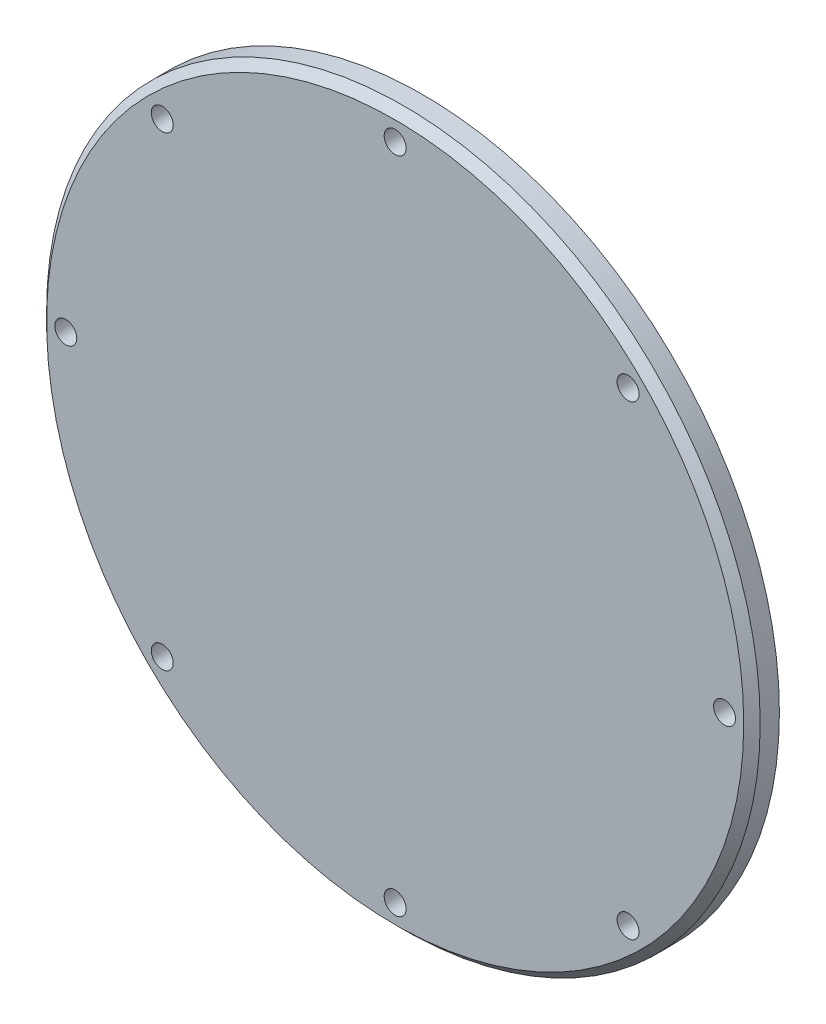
ISO-10303-21;
HEADER;
FILE_DESCRIPTION(('STEP AP214'),'2;1');
FILE_NAME('part.step','',(''),(''),'','','');
FILE_SCHEMA(('AUTOMOTIVE_DESIGN { 1 0 10303 214 1 1 1 1 }'));
ENDSEC;
DATA;
#1=APPLICATION_CONTEXT('core data for automotive mechanical design processes');
#2=APPLICATION_PROTOCOL_DEFINITION('international standard','automotive_design',2000,#1);
#3=PRODUCT_CONTEXT('',#1,'mechanical');
#4=PRODUCT('Part','Part','',(#3));
#5=PRODUCT_RELATED_PRODUCT_CATEGORY('part','',(#4));
#6=PRODUCT_DEFINITION_FORMATION('','',#4);
#7=PRODUCT_DEFINITION_CONTEXT('part definition',#1,'design');
#8=PRODUCT_DEFINITION('design','',#6,#7);
#9=PRODUCT_DEFINITION_SHAPE('','',#8);
#10=(LENGTH_UNIT() NAMED_UNIT(*) SI_UNIT(.MILLI.,.METRE.));
#11=(NAMED_UNIT(*) PLANE_ANGLE_UNIT() SI_UNIT($,.RADIAN.));
#12=(NAMED_UNIT(*) SI_UNIT($,.STERADIAN.) SOLID_ANGLE_UNIT());
#13=UNCERTAINTY_MEASURE_WITH_UNIT(LENGTH_MEASURE(1.E-05),#10,'distance_accuracy_value','');
#14=(GEOMETRIC_REPRESENTATION_CONTEXT(3) GLOBAL_UNCERTAINTY_ASSIGNED_CONTEXT((#13)) GLOBAL_UNIT_ASSIGNED_CONTEXT((#10,
#11,#12)) REPRESENTATION_CONTEXT('',''));
#15=CARTESIAN_POINT('',(0.,0.,0.));
#16=DIRECTION('',(0.,0.,1.));
#17=DIRECTION('',(1.,0.,0.));
#18=AXIS2_PLACEMENT_3D('',#15,#16,#17);
#19=CARTESIAN_POINT('',(-162.897779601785,-125.,10.));
#20=DIRECTION('',(0.,0.,1.));
#21=DIRECTION('',(1.,0.,0.));
#22=AXIS2_PLACEMENT_3D('',#19,#20,#21);
#23=PLANE('',#22);
#24=CARTESIAN_POINT('',(-162.897779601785,-125.,10.));
#25=DIRECTION('',(0.,0.,1.));
#26=DIRECTION('',(1.,0.,0.));
#27=AXIS2_PLACEMENT_3D('',#24,#25,#26);
#28=CIRCLE('',#27,127.);
#29=CARTESIAN_POINT('',(-35.8977796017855,-125.,10.));
#30=VERTEX_POINT('',#29);
#31=EDGE_CURVE('E38',#30,#30,#28,.T.);
#32=ORIENTED_EDGE('',*,*,#31,.T.);
#33=EDGE_LOOP('',(#32));
#34=FACE_BOUND('',#33,.T.);
#35=CARTESIAN_POINT('',(-78.0449658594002,-209.852813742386,10.));
#36=DIRECTION('',(0.,0.,1.));
#37=DIRECTION('',(1.,0.,0.));
#38=AXIS2_PLACEMENT_3D('',#35,#36,#37);
#39=CIRCLE('',#38,4.00000000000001);
#40=CARTESIAN_POINT('',(-74.0449658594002,-209.852813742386,10.));
#41=VERTEX_POINT('',#40);
#42=EDGE_CURVE('E82',#41,#41,#39,.T.);
#43=ORIENTED_EDGE('',*,*,#42,.F.);
#44=EDGE_LOOP('',(#43));
#45=FACE_BOUND('',#44,.T.);
#46=CARTESIAN_POINT('',(-247.750593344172,-209.852813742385,10.));
#47=DIRECTION('',(0.,0.,1.));
#48=DIRECTION('',(1.,0.,0.));
#49=AXIS2_PLACEMENT_3D('',#46,#47,#48);
#50=CIRCLE('',#49,3.99999999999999);
#51=CARTESIAN_POINT('',(-243.750593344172,-209.852813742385,10.));
#52=VERTEX_POINT('',#51);
#53=EDGE_CURVE('E70',#52,#52,#50,.T.);
#54=ORIENTED_EDGE('',*,*,#53,.F.);
#55=EDGE_LOOP('',(#54));
#56=FACE_BOUND('',#55,.T.);
#57=CARTESIAN_POINT('',(-247.75059334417,-40.1471862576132,10.));
#58=DIRECTION('',(0.,0.,1.));
#59=DIRECTION('',(1.,0.,0.));
#60=AXIS2_PLACEMENT_3D('',#57,#58,#59);
#61=CIRCLE('',#60,3.99999999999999);
#62=CARTESIAN_POINT('',(-243.75059334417,-40.1471862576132,10.));
#63=VERTEX_POINT('',#62);
#64=EDGE_CURVE('E58',#63,#63,#61,.T.);
#65=ORIENTED_EDGE('',*,*,#64,.F.);
#66=EDGE_LOOP('',(#65));
#67=FACE_BOUND('',#66,.T.);
#68=CARTESIAN_POINT('',(-78.0449658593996,-40.1471862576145,10.));
#69=DIRECTION('',(0.,0.,1.));
#70=DIRECTION('',(1.,0.,0.));
#71=AXIS2_PLACEMENT_3D('',#68,#69,#70);
#72=CIRCLE('',#71,3.99999999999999);
#73=CARTESIAN_POINT('',(-74.0449658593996,-40.1471862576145,10.));
#74=VERTEX_POINT('',#73);
#75=EDGE_CURVE('E46',#74,#74,#72,.T.);
#76=ORIENTED_EDGE('',*,*,#75,.F.);
#77=EDGE_LOOP('',(#76));
#78=FACE_BOUND('',#77,.T.);
#79=CARTESIAN_POINT('',(-162.897779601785,-5.,10.));
#80=DIRECTION('',(0.,0.,1.));
#81=DIRECTION('',(1.,0.,0.));
#82=AXIS2_PLACEMENT_3D('',#79,#80,#81);
#83=CIRCLE('',#82,3.99999999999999);
#84=CARTESIAN_POINT('',(-158.897779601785,-5.,10.));
#85=VERTEX_POINT('',#84);
#86=EDGE_CURVE('E52',#85,#85,#83,.T.);
#87=ORIENTED_EDGE('',*,*,#86,.F.);
#88=EDGE_LOOP('',(#87));
#89=FACE_BOUND('',#88,.T.);
#90=CARTESIAN_POINT('',(-282.897779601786,-124.999999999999,10.));
#91=DIRECTION('',(0.,0.,1.));
#92=DIRECTION('',(1.,0.,0.));
#93=AXIS2_PLACEMENT_3D('',#90,#91,#92);
#94=CIRCLE('',#93,3.99999999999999);
#95=CARTESIAN_POINT('',(-278.897779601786,-124.999999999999,10.));
#96=VERTEX_POINT('',#95);
#97=EDGE_CURVE('E64',#96,#96,#94,.T.);
#98=ORIENTED_EDGE('',*,*,#97,.F.);
#99=EDGE_LOOP('',(#98));
#100=FACE_BOUND('',#99,.T.);
#101=CARTESIAN_POINT('',(-162.897779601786,-245.,10.));
#102=DIRECTION('',(0.,0.,1.));
#103=DIRECTION('',(1.,0.,0.));
#104=AXIS2_PLACEMENT_3D('',#101,#102,#103);
#105=CIRCLE('',#104,3.99999999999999);
#106=CARTESIAN_POINT('',(-158.897779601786,-245.,10.));
#107=VERTEX_POINT('',#106);
#108=EDGE_CURVE('E76',#107,#107,#105,.T.);
#109=ORIENTED_EDGE('',*,*,#108,.F.);
#110=EDGE_LOOP('',(#109));
#111=FACE_BOUND('',#110,.T.);
#112=CARTESIAN_POINT('',(-42.8977796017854,-125.,10.));
#113=DIRECTION('',(0.,0.,1.));
#114=DIRECTION('',(1.,0.,0.));
#115=AXIS2_PLACEMENT_3D('',#112,#113,#114);
#116=CIRCLE('',#115,3.99999999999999);
#117=CARTESIAN_POINT('',(-38.8977796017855,-125.,10.));
#118=VERTEX_POINT('',#117);
#119=EDGE_CURVE('E88',#118,#118,#116,.T.);
#120=ORIENTED_EDGE('',*,*,#119,.F.);
#121=EDGE_LOOP('',(#120));
#122=FACE_BOUND('',#121,.T.);
#123=ADVANCED_FACE('F31',(#34,#45,#56,#67,#78,#89,#100,#111,#122),#23,.T.);
#124=CARTESIAN_POINT('',(-162.897779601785,-125.,0.));
#125=DIRECTION('',(0.,0.,1.));
#126=DIRECTION('',(1.,0.,0.));
#127=AXIS2_PLACEMENT_3D('',#124,#125,#126);
#128=PLANE('',#127);
#129=CARTESIAN_POINT('',(-78.0449658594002,-209.852813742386,0.));
#130=DIRECTION('',(0.,0.,1.));
#131=DIRECTION('',(1.,0.,0.));
#132=AXIS2_PLACEMENT_3D('',#129,#130,#131);
#133=CIRCLE('',#132,4.00000000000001);
#134=CARTESIAN_POINT('',(-74.0449658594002,-209.852813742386,0.));
#135=VERTEX_POINT('',#134);
#136=EDGE_CURVE('E85',#135,#135,#133,.T.);
#137=ORIENTED_EDGE('',*,*,#136,.T.);
#138=EDGE_LOOP('',(#137));
#139=FACE_BOUND('',#138,.T.);
#140=CARTESIAN_POINT('',(-247.750593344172,-209.852813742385,0.));
#141=DIRECTION('',(0.,0.,1.));
#142=DIRECTION('',(1.,0.,0.));
#143=AXIS2_PLACEMENT_3D('',#140,#141,#142);
#144=CIRCLE('',#143,3.99999999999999);
#145=CARTESIAN_POINT('',(-243.750593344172,-209.852813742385,0.));
#146=VERTEX_POINT('',#145);
#147=EDGE_CURVE('E73',#146,#146,#144,.T.);
#148=ORIENTED_EDGE('',*,*,#147,.T.);
#149=EDGE_LOOP('',(#148));
#150=FACE_BOUND('',#149,.T.);
#151=CARTESIAN_POINT('',(-247.75059334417,-40.1471862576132,0.));
#152=DIRECTION('',(0.,0.,1.));
#153=DIRECTION('',(1.,0.,0.));
#154=AXIS2_PLACEMENT_3D('',#151,#152,#153);
#155=CIRCLE('',#154,3.99999999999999);
#156=CARTESIAN_POINT('',(-243.75059334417,-40.1471862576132,0.));
#157=VERTEX_POINT('',#156);
#158=EDGE_CURVE('E61',#157,#157,#155,.T.);
#159=ORIENTED_EDGE('',*,*,#158,.T.);
#160=EDGE_LOOP('',(#159));
#161=FACE_BOUND('',#160,.T.);
#162=CARTESIAN_POINT('',(-78.0449658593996,-40.1471862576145,0.));
#163=DIRECTION('',(0.,0.,1.));
#164=DIRECTION('',(1.,0.,0.));
#165=AXIS2_PLACEMENT_3D('',#162,#163,#164);
#166=CIRCLE('',#165,3.99999999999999);
#167=CARTESIAN_POINT('',(-74.0449658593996,-40.1471862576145,0.));
#168=VERTEX_POINT('',#167);
#169=EDGE_CURVE('E49',#168,#168,#166,.T.);
#170=ORIENTED_EDGE('',*,*,#169,.T.);
#171=EDGE_LOOP('',(#170));
#172=FACE_BOUND('',#171,.T.);
#173=CARTESIAN_POINT('',(-162.897779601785,-125.,0.));
#174=DIRECTION('',(0.,0.,1.));
#175=DIRECTION('',(1.,0.,0.));
#176=AXIS2_PLACEMENT_3D('',#173,#174,#175);
#177=CIRCLE('',#176,130.);
#178=CARTESIAN_POINT('',(-32.8977796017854,-125.,0.));
#179=VERTEX_POINT('',#178);
#180=EDGE_CURVE('E42',#179,#179,#177,.T.);
#181=ORIENTED_EDGE('',*,*,#180,.F.);
#182=EDGE_LOOP('',(#181));
#183=FACE_BOUND('',#182,.T.);
#184=CARTESIAN_POINT('',(-162.897779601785,-5.,0.));
#185=DIRECTION('',(0.,0.,1.));
#186=DIRECTION('',(1.,0.,0.));
#187=AXIS2_PLACEMENT_3D('',#184,#185,#186);
#188=CIRCLE('',#187,3.99999999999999);
#189=CARTESIAN_POINT('',(-158.897779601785,-5.,0.));
#190=VERTEX_POINT('',#189);
#191=EDGE_CURVE('E55',#190,#190,#188,.T.);
#192=ORIENTED_EDGE('',*,*,#191,.T.);
#193=EDGE_LOOP('',(#192));
#194=FACE_BOUND('',#193,.T.);
#195=CARTESIAN_POINT('',(-282.897779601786,-124.999999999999,0.));
#196=DIRECTION('',(0.,0.,1.));
#197=DIRECTION('',(1.,0.,0.));
#198=AXIS2_PLACEMENT_3D('',#195,#196,#197);
#199=CIRCLE('',#198,3.99999999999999);
#200=CARTESIAN_POINT('',(-278.897779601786,-124.999999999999,0.));
#201=VERTEX_POINT('',#200);
#202=EDGE_CURVE('E67',#201,#201,#199,.T.);
#203=ORIENTED_EDGE('',*,*,#202,.T.);
#204=EDGE_LOOP('',(#203));
#205=FACE_BOUND('',#204,.T.);
#206=CARTESIAN_POINT('',(-162.897779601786,-245.,0.));
#207=DIRECTION('',(0.,0.,1.));
#208=DIRECTION('',(1.,0.,0.));
#209=AXIS2_PLACEMENT_3D('',#206,#207,#208);
#210=CIRCLE('',#209,3.99999999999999);
#211=CARTESIAN_POINT('',(-158.897779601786,-245.,0.));
#212=VERTEX_POINT('',#211);
#213=EDGE_CURVE('E79',#212,#212,#210,.T.);
#214=ORIENTED_EDGE('',*,*,#213,.T.);
#215=EDGE_LOOP('',(#214));
#216=FACE_BOUND('',#215,.T.);
#217=CARTESIAN_POINT('',(-42.8977796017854,-125.,0.));
#218=DIRECTION('',(0.,0.,1.));
#219=DIRECTION('',(1.,0.,0.));
#220=AXIS2_PLACEMENT_3D('',#217,#218,#219);
#221=CIRCLE('',#220,3.99999999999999);
#222=CARTESIAN_POINT('',(-38.8977796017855,-125.,0.));
#223=VERTEX_POINT('',#222);
#224=EDGE_CURVE('E91',#223,#223,#221,.T.);
#225=ORIENTED_EDGE('',*,*,#224,.T.);
#226=EDGE_LOOP('',(#225));
#227=FACE_BOUND('',#226,.T.);
#228=ADVANCED_FACE('F101',(#139,#150,#161,#172,#183,#194,#205,#216,#227),#128,.F.);
#229=CARTESIAN_POINT('',(-162.897779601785,-125.,10.));
#230=DIRECTION('',(0.,0.,-1.));
#231=DIRECTION('',(-1.,0.,0.));
#232=AXIS2_PLACEMENT_3D('',#229,#230,#231);
#233=CYLINDRICAL_SURFACE('',#232,130.);
#234=CARTESIAN_POINT('',(-162.897779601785,-125.,6.99999999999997));
#235=DIRECTION('',(0.,0.,1.));
#236=DIRECTION('',(1.,0.,0.));
#237=AXIS2_PLACEMENT_3D('',#234,#235,#236);
#238=CIRCLE('',#237,130.);
#239=CARTESIAN_POINT('',(-32.8977796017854,-125.,6.99999999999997));
#240=VERTEX_POINT('',#239);
#241=EDGE_CURVE('E10',#240,#240,#238,.F.);
#242=ORIENTED_EDGE('',*,*,#241,.T.);
#243=EDGE_LOOP('',(#242));
#244=FACE_BOUND('',#243,.T.);
#245=ORIENTED_EDGE('',*,*,#180,.T.);
#246=EDGE_LOOP('',(#245));
#247=FACE_BOUND('',#246,.T.);
#248=ADVANCED_FACE('F106',(#244,#247),#233,.T.);
#249=CARTESIAN_POINT('',(-78.0449658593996,-40.1471862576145,10.));
#250=DIRECTION('',(0.,0.,-1.));
#251=DIRECTION('',(-1.,0.,0.));
#252=AXIS2_PLACEMENT_3D('',#249,#250,#251);
#253=CYLINDRICAL_SURFACE('',#252,3.99999999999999);
#254=ORIENTED_EDGE('',*,*,#75,.T.);
#255=EDGE_LOOP('',(#254));
#256=FACE_BOUND('',#255,.T.);
#257=ORIENTED_EDGE('',*,*,#169,.F.);
#258=EDGE_LOOP('',(#257));
#259=FACE_BOUND('',#258,.T.);
#260=ADVANCED_FACE('F111',(#256,#259),#253,.F.);
#261=CARTESIAN_POINT('',(-162.897779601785,-5.,10.));
#262=DIRECTION('',(0.,0.,-1.));
#263=DIRECTION('',(-1.,0.,0.));
#264=AXIS2_PLACEMENT_3D('',#261,#262,#263);
#265=CYLINDRICAL_SURFACE('',#264,3.99999999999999);
#266=ORIENTED_EDGE('',*,*,#86,.T.);
#267=EDGE_LOOP('',(#266));
#268=FACE_BOUND('',#267,.T.);
#269=ORIENTED_EDGE('',*,*,#191,.F.);
#270=EDGE_LOOP('',(#269));
#271=FACE_BOUND('',#270,.T.);
#272=ADVANCED_FACE('F117',(#268,#271),#265,.F.);
#273=CARTESIAN_POINT('',(-247.75059334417,-40.1471862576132,10.));
#274=DIRECTION('',(0.,0.,-1.));
#275=DIRECTION('',(-1.,0.,0.));
#276=AXIS2_PLACEMENT_3D('',#273,#274,#275);
#277=CYLINDRICAL_SURFACE('',#276,3.99999999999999);
#278=ORIENTED_EDGE('',*,*,#64,.T.);
#279=EDGE_LOOP('',(#278));
#280=FACE_BOUND('',#279,.T.);
#281=ORIENTED_EDGE('',*,*,#158,.F.);
#282=EDGE_LOOP('',(#281));
#283=FACE_BOUND('',#282,.T.);
#284=ADVANCED_FACE('F152',(#280,#283),#277,.F.);
#285=CARTESIAN_POINT('',(-282.897779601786,-124.999999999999,10.));
#286=DIRECTION('',(0.,0.,-1.));
#287=DIRECTION('',(-1.,0.,0.));
#288=AXIS2_PLACEMENT_3D('',#285,#286,#287);
#289=CYLINDRICAL_SURFACE('',#288,3.99999999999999);
#290=ORIENTED_EDGE('',*,*,#97,.T.);
#291=EDGE_LOOP('',(#290));
#292=FACE_BOUND('',#291,.T.);
#293=ORIENTED_EDGE('',*,*,#202,.F.);
#294=EDGE_LOOP('',(#293));
#295=FACE_BOUND('',#294,.T.);
#296=ADVANCED_FACE('F148',(#292,#295),#289,.F.);
#297=CARTESIAN_POINT('',(-247.750593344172,-209.852813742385,10.));
#298=DIRECTION('',(0.,0.,-1.));
#299=DIRECTION('',(-1.,0.,0.));
#300=AXIS2_PLACEMENT_3D('',#297,#298,#299);
#301=CYLINDRICAL_SURFACE('',#300,3.99999999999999);
#302=ORIENTED_EDGE('',*,*,#53,.T.);
#303=EDGE_LOOP('',(#302));
#304=FACE_BOUND('',#303,.T.);
#305=ORIENTED_EDGE('',*,*,#147,.F.);
#306=EDGE_LOOP('',(#305));
#307=FACE_BOUND('',#306,.T.);
#308=ADVANCED_FACE('F144',(#304,#307),#301,.F.);
#309=CARTESIAN_POINT('',(-162.897779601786,-245.,10.));
#310=DIRECTION('',(0.,0.,-1.));
#311=DIRECTION('',(-1.,0.,0.));
#312=AXIS2_PLACEMENT_3D('',#309,#310,#311);
#313=CYLINDRICAL_SURFACE('',#312,3.99999999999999);
#314=ORIENTED_EDGE('',*,*,#108,.T.);
#315=EDGE_LOOP('',(#314));
#316=FACE_BOUND('',#315,.T.);
#317=ORIENTED_EDGE('',*,*,#213,.F.);
#318=EDGE_LOOP('',(#317));
#319=FACE_BOUND('',#318,.T.);
#320=ADVANCED_FACE('F138',(#316,#319),#313,.F.);
#321=CARTESIAN_POINT('',(-78.0449658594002,-209.852813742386,10.));
#322=DIRECTION('',(0.,0.,-1.));
#323=DIRECTION('',(-1.,0.,0.));
#324=AXIS2_PLACEMENT_3D('',#321,#322,#323);
#325=CYLINDRICAL_SURFACE('',#324,4.00000000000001);
#326=ORIENTED_EDGE('',*,*,#42,.T.);
#327=EDGE_LOOP('',(#326));
#328=FACE_BOUND('',#327,.T.);
#329=ORIENTED_EDGE('',*,*,#136,.F.);
#330=EDGE_LOOP('',(#329));
#331=FACE_BOUND('',#330,.T.);
#332=ADVANCED_FACE('F131',(#328,#331),#325,.F.);
#333=CARTESIAN_POINT('',(-42.8977796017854,-125.,10.));
#334=DIRECTION('',(0.,0.,-1.));
#335=DIRECTION('',(-1.,0.,0.));
#336=AXIS2_PLACEMENT_3D('',#333,#334,#335);
#337=CYLINDRICAL_SURFACE('',#336,3.99999999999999);
#338=ORIENTED_EDGE('',*,*,#119,.T.);
#339=EDGE_LOOP('',(#338));
#340=FACE_BOUND('',#339,.T.);
#341=ORIENTED_EDGE('',*,*,#224,.F.);
#342=EDGE_LOOP('',(#341));
#343=FACE_BOUND('',#342,.T.);
#344=ADVANCED_FACE('F97',(#340,#343),#337,.F.);
#345=CARTESIAN_POINT('',(-162.897779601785,-125.,10.));
#346=DIRECTION('',(0.,0.,-1.));
#347=DIRECTION('',(-1.,0.,0.));
#348=AXIS2_PLACEMENT_3D('',#345,#346,#347);
#349=CONICAL_SURFACE('',#348,127.,0.785398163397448);
#350=ORIENTED_EDGE('',*,*,#241,.F.);
#351=EDGE_LOOP('',(#350));
#352=FACE_BOUND('',#351,.T.);
#353=ORIENTED_EDGE('',*,*,#31,.F.);
#354=EDGE_LOOP('',(#353));
#355=FACE_BOUND('',#354,.T.);
#356=ADVANCED_FACE('F33',(#352,#355),#349,.T.);
#357=CLOSED_SHELL('',(#123,#228,#248,#260,#272,#284,#296,#308,#320,#332,#344,#356));
#358=MANIFOLD_SOLID_BREP('B2',#357);
#359=ADVANCED_BREP_SHAPE_REPRESENTATION('',(#18,#358),#14);
#360=SHAPE_DEFINITION_REPRESENTATION(#9,#359);
ENDSEC;
END-ISO-10303-21;
